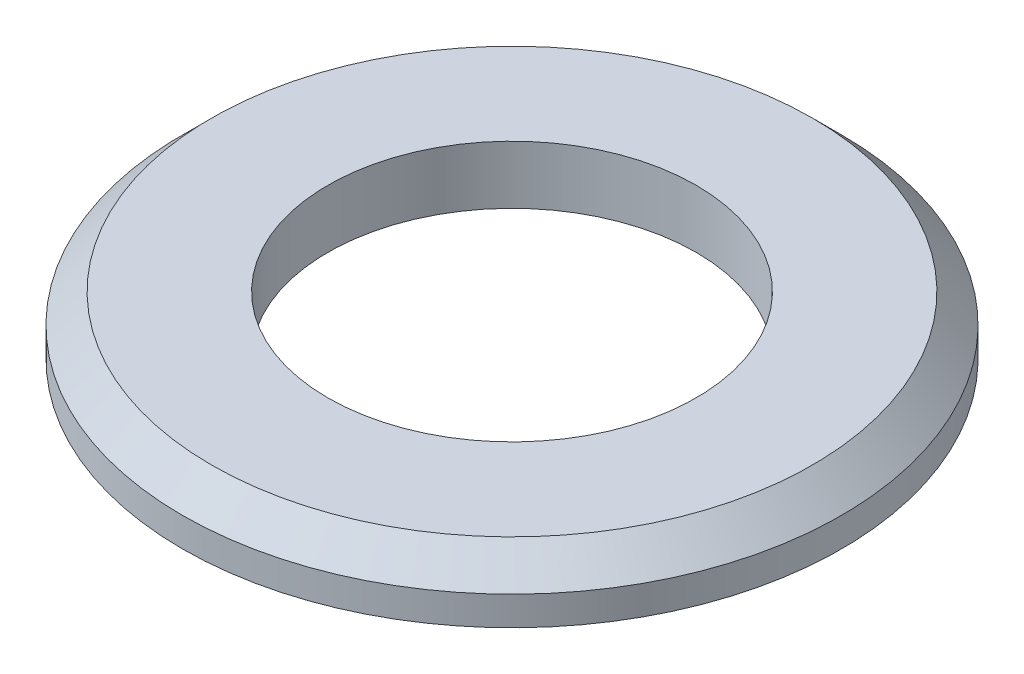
ISO-10303-21;
HEADER;
FILE_DESCRIPTION(('STEP AP214'),'2;1');
FILE_NAME('part.step','',(''),(''),'','','');
FILE_SCHEMA(('AUTOMOTIVE_DESIGN { 1 0 10303 214 1 1 1 1 }'));
ENDSEC;
DATA;
#1=APPLICATION_CONTEXT('core data for automotive mechanical design processes');
#2=APPLICATION_PROTOCOL_DEFINITION('international standard','automotive_design',2000,#1);
#3=PRODUCT_CONTEXT('',#1,'mechanical');
#4=PRODUCT('Part','Part','',(#3));
#5=PRODUCT_RELATED_PRODUCT_CATEGORY('part','',(#4));
#6=PRODUCT_DEFINITION_FORMATION('','',#4);
#7=PRODUCT_DEFINITION_CONTEXT('part definition',#1,'design');
#8=PRODUCT_DEFINITION('design','',#6,#7);
#9=PRODUCT_DEFINITION_SHAPE('','',#8);
#10=(LENGTH_UNIT() NAMED_UNIT(*) SI_UNIT(.MILLI.,.METRE.));
#11=(NAMED_UNIT(*) PLANE_ANGLE_UNIT() SI_UNIT($,.RADIAN.));
#12=(NAMED_UNIT(*) SI_UNIT($,.STERADIAN.) SOLID_ANGLE_UNIT());
#13=UNCERTAINTY_MEASURE_WITH_UNIT(LENGTH_MEASURE(1.E-05),#10,'distance_accuracy_value','');
#14=(GEOMETRIC_REPRESENTATION_CONTEXT(3) GLOBAL_UNCERTAINTY_ASSIGNED_CONTEXT((#13)) GLOBAL_UNIT_ASSIGNED_CONTEXT((#10,
#11,#12)) REPRESENTATION_CONTEXT('',''));
#15=CARTESIAN_POINT('',(0.,0.,0.));
#16=DIRECTION('',(0.,0.,1.));
#17=DIRECTION('',(1.,0.,0.));
#18=AXIS2_PLACEMENT_3D('',#15,#16,#17);
#19=CARTESIAN_POINT('',(0.,3.,0.));
#20=DIRECTION('',(0.,1.,0.));
#21=DIRECTION('',(0.,0.,1.));
#22=AXIS2_PLACEMENT_3D('',#19,#20,#21);
#23=PLANE('',#22);
#24=CARTESIAN_POINT('',(0.,3.,0.));
#25=DIRECTION('',(0.,1.,0.));
#26=DIRECTION('',(0.,0.,1.));
#27=AXIS2_PLACEMENT_3D('',#24,#25,#26);
#28=CIRCLE('',#27,15.5);
#29=CARTESIAN_POINT('',(0.,3.,15.5));
#30=VERTEX_POINT('',#29);
#31=EDGE_CURVE('E35',#30,#30,#28,.T.);
#32=ORIENTED_EDGE('',*,*,#31,.T.);
#33=EDGE_LOOP('',(#32));
#34=FACE_BOUND('',#33,.T.);
#35=CARTESIAN_POINT('',(0.,3.,0.));
#36=DIRECTION('',(0.,1.,0.));
#37=DIRECTION('',(0.,0.,1.));
#38=AXIS2_PLACEMENT_3D('',#35,#36,#37);
#39=CIRCLE('',#38,9.5);
#40=CARTESIAN_POINT('',(0.,3.,9.5));
#41=VERTEX_POINT('',#40);
#42=EDGE_CURVE('E43',#41,#41,#39,.T.);
#43=ORIENTED_EDGE('',*,*,#42,.F.);
#44=EDGE_LOOP('',(#43));
#45=FACE_BOUND('',#44,.T.);
#46=ADVANCED_FACE('F28',(#34,#45),#23,.T.);
#47=CARTESIAN_POINT('',(0.,0.,0.));
#48=DIRECTION('',(0.,1.,0.));
#49=DIRECTION('',(0.,0.,1.));
#50=AXIS2_PLACEMENT_3D('',#47,#48,#49);
#51=PLANE('',#50);
#52=CARTESIAN_POINT('',(0.,0.,0.));
#53=DIRECTION('',(0.,1.,0.));
#54=DIRECTION('',(0.,0.,1.));
#55=AXIS2_PLACEMENT_3D('',#52,#53,#54);
#56=CIRCLE('',#55,17.);
#57=CARTESIAN_POINT('',(0.,0.,17.));
#58=VERTEX_POINT('',#57);
#59=EDGE_CURVE('E39',#58,#58,#56,.T.);
#60=ORIENTED_EDGE('',*,*,#59,.F.);
#61=EDGE_LOOP('',(#60));
#62=FACE_BOUND('',#61,.T.);
#63=CARTESIAN_POINT('',(0.,0.,0.));
#64=DIRECTION('',(0.,1.,0.));
#65=DIRECTION('',(0.,0.,1.));
#66=AXIS2_PLACEMENT_3D('',#63,#64,#65);
#67=CIRCLE('',#66,9.5);
#68=CARTESIAN_POINT('',(0.,0.,9.5));
#69=VERTEX_POINT('',#68);
#70=EDGE_CURVE('E48',#69,#69,#67,.T.);
#71=ORIENTED_EDGE('',*,*,#70,.T.);
#72=EDGE_LOOP('',(#71));
#73=FACE_BOUND('',#72,.T.);
#74=ADVANCED_FACE('F52',(#62,#73),#51,.F.);
#75=CARTESIAN_POINT('',(0.,3.,0.));
#76=DIRECTION('',(0.,-1.,0.));
#77=DIRECTION('',(0.,0.,-1.));
#78=AXIS2_PLACEMENT_3D('',#75,#76,#77);
#79=CYLINDRICAL_SURFACE('',#78,17.);
#80=CARTESIAN_POINT('',(0.,1.5,0.));
#81=DIRECTION('',(0.,1.,0.));
#82=DIRECTION('',(0.,0.,1.));
#83=AXIS2_PLACEMENT_3D('',#80,#81,#82);
#84=CIRCLE('',#83,17.);
#85=CARTESIAN_POINT('',(0.,1.5,17.));
#86=VERTEX_POINT('',#85);
#87=EDGE_CURVE('E10',#86,#86,#84,.F.);
#88=ORIENTED_EDGE('',*,*,#87,.T.);
#89=EDGE_LOOP('',(#88));
#90=FACE_BOUND('',#89,.T.);
#91=ORIENTED_EDGE('',*,*,#59,.T.);
#92=EDGE_LOOP('',(#91));
#93=FACE_BOUND('',#92,.T.);
#94=ADVANCED_FACE('F30',(#90,#93),#79,.T.);
#95=CARTESIAN_POINT('',(0.,3.,0.));
#96=DIRECTION('',(0.,-1.,0.));
#97=DIRECTION('',(0.,0.,-1.));
#98=AXIS2_PLACEMENT_3D('',#95,#96,#97);
#99=CYLINDRICAL_SURFACE('',#98,9.5);
#100=ORIENTED_EDGE('',*,*,#42,.T.);
#101=EDGE_LOOP('',(#100));
#102=FACE_BOUND('',#101,.T.);
#103=ORIENTED_EDGE('',*,*,#70,.F.);
#104=EDGE_LOOP('',(#103));
#105=FACE_BOUND('',#104,.T.);
#106=ADVANCED_FACE('F54',(#102,#105),#99,.F.);
#107=CARTESIAN_POINT('',(0.,3.,0.));
#108=DIRECTION('',(0.,-1.,0.));
#109=DIRECTION('',(0.,0.,-1.));
#110=AXIS2_PLACEMENT_3D('',#107,#108,#109);
#111=CONICAL_SURFACE('',#110,15.5,0.78539816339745);
#112=ORIENTED_EDGE('',*,*,#87,.F.);
#113=EDGE_LOOP('',(#112));
#114=FACE_BOUND('',#113,.T.);
#115=ORIENTED_EDGE('',*,*,#31,.F.);
#116=EDGE_LOOP('',(#115));
#117=FACE_BOUND('',#116,.T.);
#118=ADVANCED_FACE('F56',(#114,#117),#111,.T.);
#119=CLOSED_SHELL('',(#46,#74,#94,#106,#118));
#120=MANIFOLD_SOLID_BREP('B2',#119);
#121=ADVANCED_BREP_SHAPE_REPRESENTATION('',(#18,#120),#14);
#122=SHAPE_DEFINITION_REPRESENTATION(#9,#121);
ENDSEC;
END-ISO-10303-21;
